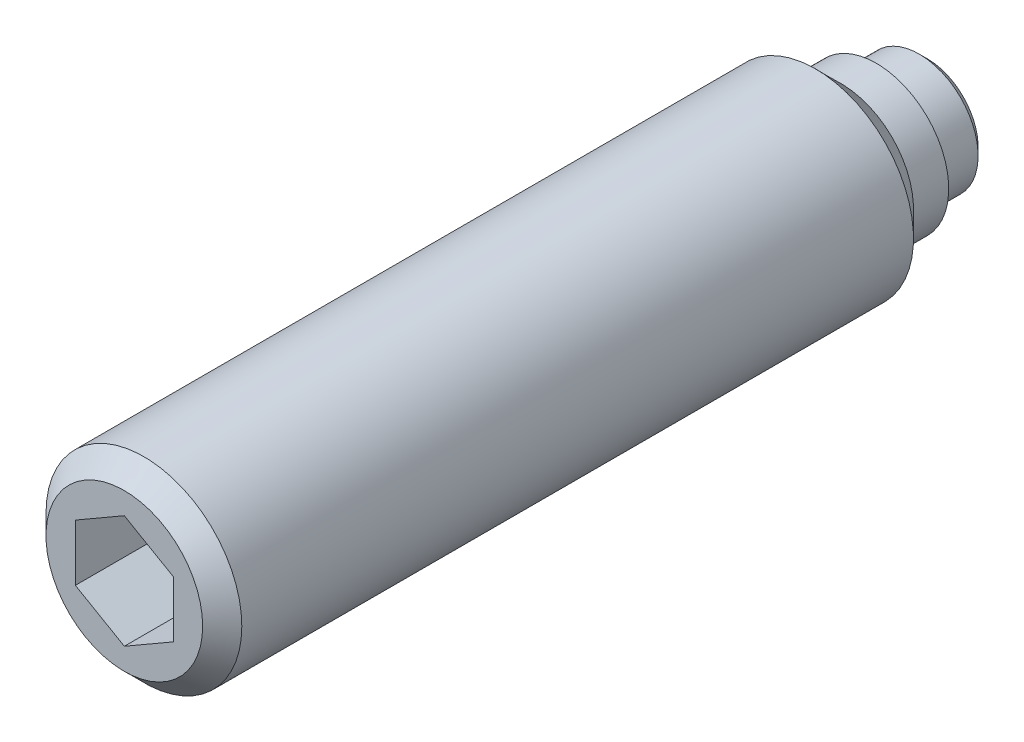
ISO-10303-21;
HEADER;
FILE_DESCRIPTION(('STEP AP214'),'2;1');
FILE_NAME('part.step','',(''),(''),'','','');
FILE_SCHEMA(('AUTOMOTIVE_DESIGN { 1 0 10303 214 1 1 1 1 }'));
ENDSEC;
DATA;
#1=APPLICATION_CONTEXT('core data for automotive mechanical design processes');
#2=APPLICATION_PROTOCOL_DEFINITION('international standard','automotive_design',2000,#1);
#3=PRODUCT_CONTEXT('',#1,'mechanical');
#4=PRODUCT('Part','Part','',(#3));
#5=PRODUCT_RELATED_PRODUCT_CATEGORY('part','',(#4));
#6=PRODUCT_DEFINITION_FORMATION('','',#4);
#7=PRODUCT_DEFINITION_CONTEXT('part definition',#1,'design');
#8=PRODUCT_DEFINITION('design','',#6,#7);
#9=PRODUCT_DEFINITION_SHAPE('','',#8);
#10=(LENGTH_UNIT() NAMED_UNIT(*) SI_UNIT(.MILLI.,.METRE.));
#11=(NAMED_UNIT(*) PLANE_ANGLE_UNIT() SI_UNIT($,.RADIAN.));
#12=(NAMED_UNIT(*) SI_UNIT($,.STERADIAN.) SOLID_ANGLE_UNIT());
#13=UNCERTAINTY_MEASURE_WITH_UNIT(LENGTH_MEASURE(1.E-05),#10,'distance_accuracy_value','');
#14=(GEOMETRIC_REPRESENTATION_CONTEXT(3) GLOBAL_UNCERTAINTY_ASSIGNED_CONTEXT((#13)) GLOBAL_UNIT_ASSIGNED_CONTEXT((#10,
#11,#12)) REPRESENTATION_CONTEXT('',''));
#15=CARTESIAN_POINT('',(0.,0.,0.));
#16=DIRECTION('',(0.,0.,1.));
#17=DIRECTION('',(1.,0.,0.));
#18=AXIS2_PLACEMENT_3D('',#15,#16,#17);
#19=CARTESIAN_POINT('',(0.,1.85,1.3));
#20=DIRECTION('',(0.,0.,1.));
#21=DIRECTION('',(1.,0.,0.));
#22=AXIS2_PLACEMENT_3D('',#19,#20,#21);
#23=PLANE('',#22);
#24=CARTESIAN_POINT('',(0.,0.,1.3));
#25=DIRECTION('',(0.,0.,-1.));
#26=DIRECTION('',(-1.,0.,0.));
#27=AXIS2_PLACEMENT_3D('',#24,#25,#26);
#28=CIRCLE('',#27,1.5);
#29=CARTESIAN_POINT('',(-1.5,0.,1.3));
#30=VERTEX_POINT('',#29);
#31=EDGE_CURVE('E130',#30,#30,#28,.T.);
#32=ORIENTED_EDGE('',*,*,#31,.F.);
#33=EDGE_LOOP('',(#32));
#34=FACE_BOUND('',#33,.T.);
#35=CARTESIAN_POINT('',(0.,0.,1.3));
#36=DIRECTION('',(0.,0.,-1.));
#37=DIRECTION('',(-1.,0.,0.));
#38=AXIS2_PLACEMENT_3D('',#35,#36,#37);
#39=CIRCLE('',#38,1.85);
#40=CARTESIAN_POINT('',(-1.85,0.,1.3));
#41=VERTEX_POINT('',#40);
#42=EDGE_CURVE('E133',#41,#41,#39,.T.);
#43=ORIENTED_EDGE('',*,*,#42,.T.);
#44=EDGE_LOOP('',(#43));
#45=FACE_BOUND('',#44,.T.);
#46=ADVANCED_FACE('F14',(#34,#45),#23,.F.);
#47=CARTESIAN_POINT('',(0.,0.,1.3));
#48=DIRECTION('',(0.,0.,-1.));
#49=DIRECTION('',(-1.,0.,0.));
#50=AXIS2_PLACEMENT_3D('',#47,#48,#49);
#51=CYLINDRICAL_SURFACE('',#50,2.5);
#52=CARTESIAN_POINT('',(0.,0.,20.));
#53=DIRECTION('',(0.,0.,1.));
#54=DIRECTION('',(1.,0.,0.));
#55=AXIS2_PLACEMENT_3D('',#52,#53,#54);
#56=CIRCLE('',#55,2.5);
#57=CARTESIAN_POINT('',(2.5,0.,20.));
#58=VERTEX_POINT('',#57);
#59=EDGE_CURVE('E9',#58,#58,#56,.F.);
#60=ORIENTED_EDGE('',*,*,#59,.T.);
#61=EDGE_LOOP('',(#60));
#62=FACE_BOUND('',#61,.T.);
#63=CARTESIAN_POINT('',(0.,0.,2.85));
#64=DIRECTION('',(0.,0.,-1.));
#65=DIRECTION('',(-1.,0.,0.));
#66=AXIS2_PLACEMENT_3D('',#63,#64,#65);
#67=CIRCLE('',#66,2.5);
#68=CARTESIAN_POINT('',(-2.5,0.,2.85));
#69=VERTEX_POINT('',#68);
#70=EDGE_CURVE('E139',#69,#69,#67,.T.);
#71=ORIENTED_EDGE('',*,*,#70,.F.);
#72=EDGE_LOOP('',(#71));
#73=FACE_BOUND('',#72,.T.);
#74=ADVANCED_FACE('F157',(#62,#73),#51,.T.);
#75=CARTESIAN_POINT('',(0.,0.,2.85));
#76=DIRECTION('',(0.,0.,1.));
#77=DIRECTION('',(1.,0.,0.));
#78=AXIS2_PLACEMENT_3D('',#75,#76,#77);
#79=CONICAL_SURFACE('',#78,2.5,0.785398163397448);
#80=CARTESIAN_POINT('',(0.,0.,2.2));
#81=DIRECTION('',(0.,0.,-1.));
#82=DIRECTION('',(-1.,0.,0.));
#83=AXIS2_PLACEMENT_3D('',#80,#81,#82);
#84=CIRCLE('',#83,1.85);
#85=CARTESIAN_POINT('',(-1.85,0.,2.2));
#86=VERTEX_POINT('',#85);
#87=EDGE_CURVE('E136',#86,#86,#84,.T.);
#88=ORIENTED_EDGE('',*,*,#87,.F.);
#89=EDGE_LOOP('',(#88));
#90=FACE_BOUND('',#89,.T.);
#91=ORIENTED_EDGE('',*,*,#70,.T.);
#92=EDGE_LOOP('',(#91));
#93=FACE_BOUND('',#92,.T.);
#94=ADVANCED_FACE('F164',(#90,#93),#79,.T.);
#95=CARTESIAN_POINT('',(0.,0.,1.3));
#96=DIRECTION('',(0.,0.,-1.));
#97=DIRECTION('',(-1.,0.,0.));
#98=AXIS2_PLACEMENT_3D('',#95,#96,#97);
#99=CYLINDRICAL_SURFACE('',#98,1.85);
#100=ORIENTED_EDGE('',*,*,#42,.F.);
#101=EDGE_LOOP('',(#100));
#102=FACE_BOUND('',#101,.T.);
#103=ORIENTED_EDGE('',*,*,#87,.T.);
#104=EDGE_LOOP('',(#103));
#105=FACE_BOUND('',#104,.T.);
#106=ADVANCED_FACE('F172',(#102,#105),#99,.T.);
#107=CARTESIAN_POINT('',(0.,0.,-0.5));
#108=DIRECTION('',(0.,0.,-1.));
#109=DIRECTION('',(-1.,0.,0.));
#110=AXIS2_PLACEMENT_3D('',#107,#108,#109);
#111=CYLINDRICAL_SURFACE('',#110,1.5);
#112=CARTESIAN_POINT('',(0.,0.,0.2));
#113=DIRECTION('',(0.,0.,-1.));
#114=DIRECTION('',(-1.,0.,0.));
#115=AXIS2_PLACEMENT_3D('',#112,#113,#114);
#116=CIRCLE('',#115,1.5);
#117=CARTESIAN_POINT('',(-1.5,0.,0.2));
#118=VERTEX_POINT('',#117);
#119=EDGE_CURVE('E127',#118,#118,#116,.T.);
#120=ORIENTED_EDGE('',*,*,#119,.F.);
#121=EDGE_LOOP('',(#120));
#122=FACE_BOUND('',#121,.T.);
#123=ORIENTED_EDGE('',*,*,#31,.T.);
#124=EDGE_LOOP('',(#123));
#125=FACE_BOUND('',#124,.T.);
#126=ADVANCED_FACE('F170',(#122,#125),#111,.T.);
#127=CARTESIAN_POINT('',(0.,0.,0.2));
#128=DIRECTION('',(0.,0.,1.));
#129=DIRECTION('',(1.,0.,0.));
#130=AXIS2_PLACEMENT_3D('',#127,#128,#129);
#131=CONICAL_SURFACE('',#130,1.5,0.785398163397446);
#132=CARTESIAN_POINT('',(0.,0.,0.));
#133=DIRECTION('',(0.,0.,-1.));
#134=DIRECTION('',(-1.,0.,0.));
#135=AXIS2_PLACEMENT_3D('',#132,#133,#134);
#136=CIRCLE('',#135,1.3);
#137=CARTESIAN_POINT('',(-1.3,0.,0.));
#138=VERTEX_POINT('',#137);
#139=EDGE_CURVE('E124',#138,#138,#136,.T.);
#140=ORIENTED_EDGE('',*,*,#139,.F.);
#141=EDGE_LOOP('',(#140));
#142=FACE_BOUND('',#141,.T.);
#143=ORIENTED_EDGE('',*,*,#119,.T.);
#144=EDGE_LOOP('',(#143));
#145=FACE_BOUND('',#144,.T.);
#146=ADVANCED_FACE('F204',(#142,#145),#131,.T.);
#147=CARTESIAN_POINT('',(0.,1.3,0.));
#148=DIRECTION('',(0.,0.,1.));
#149=DIRECTION('',(1.,0.,0.));
#150=AXIS2_PLACEMENT_3D('',#147,#148,#149);
#151=PLANE('',#150);
#152=CARTESIAN_POINT('',(0.,0.,0.));
#153=DIRECTION('',(0.,0.,-1.));
#154=DIRECTION('',(-1.,0.,0.));
#155=AXIS2_PLACEMENT_3D('',#152,#153,#154);
#156=CIRCLE('',#155,0.5);
#157=CARTESIAN_POINT('',(-0.5,0.,0.));
#158=VERTEX_POINT('',#157);
#159=EDGE_CURVE('E114',#158,#158,#156,.T.);
#160=ORIENTED_EDGE('',*,*,#159,.F.);
#161=EDGE_LOOP('',(#160));
#162=FACE_BOUND('',#161,.T.);
#163=ORIENTED_EDGE('',*,*,#139,.T.);
#164=EDGE_LOOP('',(#163));
#165=FACE_BOUND('',#164,.T.);
#166=ADVANCED_FACE('F212',(#162,#165),#151,.F.);
#167=CARTESIAN_POINT('',(0.,0.,0.));
#168=DIRECTION('',(0.,0.,1.));
#169=DIRECTION('',(1.,0.,0.));
#170=AXIS2_PLACEMENT_3D('',#167,#168,#169);
#171=CONICAL_SURFACE('',#170,0.5,0.785398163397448);
#172=CARTESIAN_POINT('',(0.,0.,-0.5));
#173=VERTEX_POINT('',#172);
#174=VERTEX_LOOP('',#173);
#175=FACE_BOUND('',#174,.T.);
#176=ORIENTED_EDGE('',*,*,#159,.T.);
#177=EDGE_LOOP('',(#176));
#178=FACE_BOUND('',#177,.T.);
#179=ADVANCED_FACE('F220',(#175,#178),#171,.T.);
#180=CARTESIAN_POINT('',(0.,0.,20.5));
#181=DIRECTION('',(0.,0.,1.));
#182=DIRECTION('',(1.,0.,0.));
#183=AXIS2_PLACEMENT_3D('',#180,#181,#182);
#184=PLANE('',#183);
#185=CARTESIAN_POINT('',(0.,0.,20.5));
#186=DIRECTION('',(0.,0.,1.));
#187=DIRECTION('',(1.,0.,0.));
#188=AXIS2_PLACEMENT_3D('',#185,#186,#187);
#189=CIRCLE('',#188,2.);
#190=CARTESIAN_POINT('',(2.,0.,20.5));
#191=VERTEX_POINT('',#190);
#192=EDGE_CURVE('E22',#191,#191,#189,.T.);
#193=ORIENTED_EDGE('',*,*,#192,.T.);
#194=EDGE_LOOP('',(#193));
#195=FACE_BOUND('',#194,.T.);
#196=DIRECTION('',(-0.866025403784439,0.5,0.));
#197=VECTOR('',#196,1.);
#198=CARTESIAN_POINT('',(1.25,0.721687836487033,20.5));
#199=LINE('',#198,#197);
#200=CARTESIAN_POINT('',(1.25,0.721687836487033,20.5));
#201=VERTEX_POINT('',#200);
#202=CARTESIAN_POINT('',(0.,1.44337567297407,20.5));
#203=VERTEX_POINT('',#202);
#204=EDGE_CURVE('E29',#201,#203,#199,.T.);
#205=ORIENTED_EDGE('',*,*,#204,.F.);
#206=DIRECTION('',(0.,1.,0.));
#207=VECTOR('',#206,1.);
#208=CARTESIAN_POINT('',(1.25,-0.721687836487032,20.5));
#209=LINE('',#208,#207);
#210=CARTESIAN_POINT('',(1.25,-0.721687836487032,20.5));
#211=VERTEX_POINT('',#210);
#212=EDGE_CURVE('E88',#211,#201,#209,.T.);
#213=ORIENTED_EDGE('',*,*,#212,.F.);
#214=DIRECTION('',(0.866025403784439,0.5,0.));
#215=VECTOR('',#214,1.);
#216=CARTESIAN_POINT('',(0.,-1.44337567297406,20.5));
#217=LINE('',#216,#215);
#218=CARTESIAN_POINT('',(0.,-1.44337567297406,20.5));
#219=VERTEX_POINT('',#218);
#220=EDGE_CURVE('E91',#219,#211,#217,.T.);
#221=ORIENTED_EDGE('',*,*,#220,.F.);
#222=DIRECTION('',(0.866025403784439,-0.5,0.));
#223=VECTOR('',#222,1.);
#224=CARTESIAN_POINT('',(-1.25,-0.721687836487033,20.5));
#225=LINE('',#224,#223);
#226=CARTESIAN_POINT('',(-1.25,-0.721687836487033,20.5));
#227=VERTEX_POINT('',#226);
#228=EDGE_CURVE('E107',#227,#219,#225,.T.);
#229=ORIENTED_EDGE('',*,*,#228,.F.);
#230=DIRECTION('',(0.,-1.,0.));
#231=VECTOR('',#230,1.);
#232=CARTESIAN_POINT('',(-1.25,0.721687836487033,20.5));
#233=LINE('',#232,#231);
#234=CARTESIAN_POINT('',(-1.25,0.721687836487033,20.5));
#235=VERTEX_POINT('',#234);
#236=EDGE_CURVE('E104',#235,#227,#233,.T.);
#237=ORIENTED_EDGE('',*,*,#236,.F.);
#238=DIRECTION('',(-0.866025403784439,-0.5,0.));
#239=VECTOR('',#238,1.);
#240=CARTESIAN_POINT('',(0.,1.44337567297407,20.5));
#241=LINE('',#240,#239);
#242=EDGE_CURVE('E102',#203,#235,#241,.T.);
#243=ORIENTED_EDGE('',*,*,#242,.F.);
#244=EDGE_LOOP('',(#205,#213,#221,#229,#237,#243));
#245=FACE_BOUND('',#244,.T.);
#246=ADVANCED_FACE('F144',(#195,#245),#184,.T.);
#247=CARTESIAN_POINT('',(1.25,0.721687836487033,17.5));
#248=DIRECTION('',(0.5,0.866025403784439,0.));
#249=DIRECTION('',(-0.866025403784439,0.5,0.));
#250=AXIS2_PLACEMENT_3D('',#247,#248,#249);
#251=PLANE('',#250);
#252=ORIENTED_EDGE('',*,*,#204,.T.);
#253=DIRECTION('',(0.,0.,1.));
#254=VECTOR('',#253,1.);
#255=CARTESIAN_POINT('',(0.,1.44337567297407,17.5));
#256=LINE('',#255,#254);
#257=CARTESIAN_POINT('',(0.,1.44337567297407,17.5));
#258=VERTEX_POINT('',#257);
#259=EDGE_CURVE('E65',#258,#203,#256,.T.);
#260=ORIENTED_EDGE('',*,*,#259,.F.);
#261=DIRECTION('',(-0.866025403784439,0.5,0.));
#262=VECTOR('',#261,1.);
#263=CARTESIAN_POINT('',(1.25,0.721687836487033,17.5));
#264=LINE('',#263,#262);
#265=CARTESIAN_POINT('',(1.25,0.721687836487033,17.5));
#266=VERTEX_POINT('',#265);
#267=EDGE_CURVE('E69',#266,#258,#264,.T.);
#268=ORIENTED_EDGE('',*,*,#267,.F.);
#269=DIRECTION('',(0.,0.,1.));
#270=VECTOR('',#269,1.);
#271=CARTESIAN_POINT('',(1.25,0.721687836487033,17.5));
#272=LINE('',#271,#270);
#273=EDGE_CURVE('E112',#266,#201,#272,.T.);
#274=ORIENTED_EDGE('',*,*,#273,.T.);
#275=EDGE_LOOP('',(#252,#260,#268,#274));
#276=FACE_BOUND('',#275,.T.);
#277=ADVANCED_FACE('F67',(#276),#251,.F.);
#278=CARTESIAN_POINT('',(1.25,-0.721687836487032,17.5));
#279=DIRECTION('',(1.,0.,0.));
#280=DIRECTION('',(0.,0.,-1.));
#281=AXIS2_PLACEMENT_3D('',#278,#279,#280);
#282=PLANE('',#281);
#283=ORIENTED_EDGE('',*,*,#212,.T.);
#284=ORIENTED_EDGE('',*,*,#273,.F.);
#285=DIRECTION('',(0.,1.,0.));
#286=VECTOR('',#285,1.);
#287=CARTESIAN_POINT('',(1.25,-0.721687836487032,17.5));
#288=LINE('',#287,#286);
#289=CARTESIAN_POINT('',(1.25,-0.721687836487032,17.5));
#290=VERTEX_POINT('',#289);
#291=EDGE_CURVE('E75',#290,#266,#288,.T.);
#292=ORIENTED_EDGE('',*,*,#291,.F.);
#293=DIRECTION('',(0.,0.,1.));
#294=VECTOR('',#293,1.);
#295=CARTESIAN_POINT('',(1.25,-0.721687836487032,17.5));
#296=LINE('',#295,#294);
#297=EDGE_CURVE('E115',#290,#211,#296,.T.);
#298=ORIENTED_EDGE('',*,*,#297,.T.);
#299=EDGE_LOOP('',(#283,#284,#292,#298));
#300=FACE_BOUND('',#299,.T.);
#301=ADVANCED_FACE('F243',(#300),#282,.F.);
#302=CARTESIAN_POINT('',(0.,-1.44337567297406,17.5));
#303=DIRECTION('',(0.5,-0.866025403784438,0.));
#304=DIRECTION('',(0.866025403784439,0.5,0.));
#305=AXIS2_PLACEMENT_3D('',#302,#303,#304);
#306=PLANE('',#305);
#307=ORIENTED_EDGE('',*,*,#220,.T.);
#308=ORIENTED_EDGE('',*,*,#297,.F.);
#309=DIRECTION('',(0.866025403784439,0.5,0.));
#310=VECTOR('',#309,1.);
#311=CARTESIAN_POINT('',(0.,-1.44337567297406,17.5));
#312=LINE('',#311,#310);
#313=CARTESIAN_POINT('',(0.,-1.44337567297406,17.5));
#314=VERTEX_POINT('',#313);
#315=EDGE_CURVE('E98',#314,#290,#312,.T.);
#316=ORIENTED_EDGE('',*,*,#315,.F.);
#317=DIRECTION('',(0.,0.,1.));
#318=VECTOR('',#317,1.);
#319=CARTESIAN_POINT('',(0.,-1.44337567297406,17.5));
#320=LINE('',#319,#318);
#321=EDGE_CURVE('E117',#314,#219,#320,.T.);
#322=ORIENTED_EDGE('',*,*,#321,.T.);
#323=EDGE_LOOP('',(#307,#308,#316,#322));
#324=FACE_BOUND('',#323,.T.);
#325=ADVANCED_FACE('F251',(#324),#306,.F.);
#326=CARTESIAN_POINT('',(-1.25,-0.721687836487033,17.5));
#327=DIRECTION('',(-0.5,-0.866025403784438,0.));
#328=DIRECTION('',(0.866025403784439,-0.5,0.));
#329=AXIS2_PLACEMENT_3D('',#326,#327,#328);
#330=PLANE('',#329);
#331=ORIENTED_EDGE('',*,*,#228,.T.);
#332=ORIENTED_EDGE('',*,*,#321,.F.);
#333=DIRECTION('',(0.866025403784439,-0.5,0.));
#334=VECTOR('',#333,1.);
#335=CARTESIAN_POINT('',(-1.25,-0.721687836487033,17.5));
#336=LINE('',#335,#334);
#337=CARTESIAN_POINT('',(-1.25,-0.721687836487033,17.5));
#338=VERTEX_POINT('',#337);
#339=EDGE_CURVE('E95',#338,#314,#336,.T.);
#340=ORIENTED_EDGE('',*,*,#339,.F.);
#341=DIRECTION('',(0.,0.,1.));
#342=VECTOR('',#341,1.);
#343=CARTESIAN_POINT('',(-1.25,-0.721687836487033,17.5));
#344=LINE('',#343,#342);
#345=EDGE_CURVE('E119',#338,#227,#344,.T.);
#346=ORIENTED_EDGE('',*,*,#345,.T.);
#347=EDGE_LOOP('',(#331,#332,#340,#346));
#348=FACE_BOUND('',#347,.T.);
#349=ADVANCED_FACE('F260',(#348),#330,.F.);
#350=CARTESIAN_POINT('',(-1.25,0.721687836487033,17.5));
#351=DIRECTION('',(-1.,0.,0.));
#352=DIRECTION('',(0.,-1.,0.));
#353=AXIS2_PLACEMENT_3D('',#350,#351,#352);
#354=PLANE('',#353);
#355=ORIENTED_EDGE('',*,*,#236,.T.);
#356=ORIENTED_EDGE('',*,*,#345,.F.);
#357=DIRECTION('',(0.,-1.,0.));
#358=VECTOR('',#357,1.);
#359=CARTESIAN_POINT('',(-1.25,0.721687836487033,17.5));
#360=LINE('',#359,#358);
#361=CARTESIAN_POINT('',(-1.25,0.721687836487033,17.5));
#362=VERTEX_POINT('',#361);
#363=EDGE_CURVE('E83',#362,#338,#360,.T.);
#364=ORIENTED_EDGE('',*,*,#363,.F.);
#365=DIRECTION('',(0.,0.,1.));
#366=VECTOR('',#365,1.);
#367=CARTESIAN_POINT('',(-1.25,0.721687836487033,17.5));
#368=LINE('',#367,#366);
#369=EDGE_CURVE('E74',#362,#235,#368,.T.);
#370=ORIENTED_EDGE('',*,*,#369,.T.);
#371=EDGE_LOOP('',(#355,#356,#364,#370));
#372=FACE_BOUND('',#371,.T.);
#373=ADVANCED_FACE('F269',(#372),#354,.F.);
#374=CARTESIAN_POINT('',(0.,1.44337567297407,17.5));
#375=DIRECTION('',(-0.5,0.866025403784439,0.));
#376=DIRECTION('',(-0.866025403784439,-0.5,0.));
#377=AXIS2_PLACEMENT_3D('',#374,#375,#376);
#378=PLANE('',#377);
#379=ORIENTED_EDGE('',*,*,#242,.T.);
#380=ORIENTED_EDGE('',*,*,#369,.F.);
#381=DIRECTION('',(-0.866025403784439,-0.5,0.));
#382=VECTOR('',#381,1.);
#383=CARTESIAN_POINT('',(0.,1.44337567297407,17.5));
#384=LINE('',#383,#382);
#385=EDGE_CURVE('E78',#258,#362,#384,.T.);
#386=ORIENTED_EDGE('',*,*,#385,.F.);
#387=ORIENTED_EDGE('',*,*,#259,.T.);
#388=EDGE_LOOP('',(#379,#380,#386,#387));
#389=FACE_BOUND('',#388,.T.);
#390=ADVANCED_FACE('F79',(#389),#378,.F.);
#391=CARTESIAN_POINT('',(0.,0.,17.5));
#392=DIRECTION('',(0.,0.,1.));
#393=DIRECTION('',(1.,0.,0.));
#394=AXIS2_PLACEMENT_3D('',#391,#392,#393);
#395=PLANE('',#394);
#396=ORIENTED_EDGE('',*,*,#267,.T.);
#397=ORIENTED_EDGE('',*,*,#385,.T.);
#398=ORIENTED_EDGE('',*,*,#363,.T.);
#399=ORIENTED_EDGE('',*,*,#339,.T.);
#400=ORIENTED_EDGE('',*,*,#315,.T.);
#401=ORIENTED_EDGE('',*,*,#291,.T.);
#402=EDGE_LOOP('',(#396,#397,#398,#399,#400,#401));
#403=FACE_BOUND('',#402,.T.);
#404=ADVANCED_FACE('F85',(#403),#395,.T.);
#405=CARTESIAN_POINT('',(0.,0.,20.5));
#406=DIRECTION('',(0.,0.,-1.));
#407=DIRECTION('',(-1.,0.,0.));
#408=AXIS2_PLACEMENT_3D('',#405,#406,#407);
#409=CONICAL_SURFACE('',#408,2.,0.785398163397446);
#410=ORIENTED_EDGE('',*,*,#59,.F.);
#411=EDGE_LOOP('',(#410));
#412=FACE_BOUND('',#411,.T.);
#413=ORIENTED_EDGE('',*,*,#192,.F.);
#414=EDGE_LOOP('',(#413));
#415=FACE_BOUND('',#414,.T.);
#416=ADVANCED_FACE('F16',(#412,#415),#409,.T.);
#417=CLOSED_SHELL('',(#46,#74,#94,#106,#126,#146,#166,#179,#246,#277,#301,#325,#349,#373,#390,
#404,#416));
#418=MANIFOLD_SOLID_BREP('B1',#417);
#419=ADVANCED_BREP_SHAPE_REPRESENTATION('',(#18,#418),#14);
#420=SHAPE_DEFINITION_REPRESENTATION(#9,#419);
ENDSEC;
END-ISO-10303-21;
